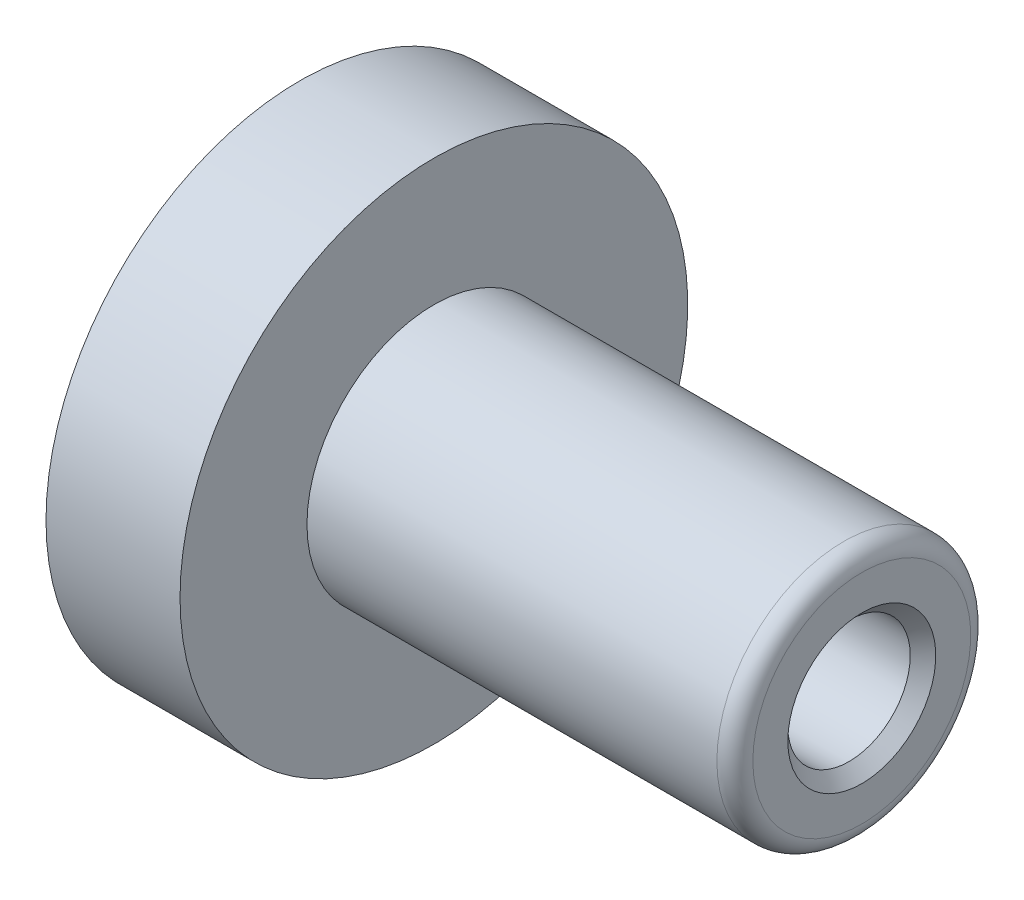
ISO-10303-21;
HEADER;
FILE_DESCRIPTION(('STEP AP214'),'2;1');
FILE_NAME('part.step','',(''),(''),'','','');
FILE_SCHEMA(('AUTOMOTIVE_DESIGN { 1 0 10303 214 1 1 1 1 }'));
ENDSEC;
DATA;
#1=APPLICATION_CONTEXT('core data for automotive mechanical design processes');
#2=APPLICATION_PROTOCOL_DEFINITION('international standard','automotive_design',2000,#1);
#3=PRODUCT_CONTEXT('',#1,'mechanical');
#4=PRODUCT('Part','Part','',(#3));
#5=PRODUCT_RELATED_PRODUCT_CATEGORY('part','',(#4));
#6=PRODUCT_DEFINITION_FORMATION('','',#4);
#7=PRODUCT_DEFINITION_CONTEXT('part definition',#1,'design');
#8=PRODUCT_DEFINITION('design','',#6,#7);
#9=PRODUCT_DEFINITION_SHAPE('','',#8);
#10=(LENGTH_UNIT() NAMED_UNIT(*) SI_UNIT(.MILLI.,.METRE.));
#11=(NAMED_UNIT(*) PLANE_ANGLE_UNIT() SI_UNIT($,.RADIAN.));
#12=(NAMED_UNIT(*) SI_UNIT($,.STERADIAN.) SOLID_ANGLE_UNIT());
#13=UNCERTAINTY_MEASURE_WITH_UNIT(LENGTH_MEASURE(1.E-05),#10,'distance_accuracy_value','');
#14=(GEOMETRIC_REPRESENTATION_CONTEXT(3) GLOBAL_UNCERTAINTY_ASSIGNED_CONTEXT((#13)) GLOBAL_UNIT_ASSIGNED_CONTEXT((#10,
#11,#12)) REPRESENTATION_CONTEXT('',''));
#15=CARTESIAN_POINT('',(0.,0.,0.));
#16=DIRECTION('',(0.,0.,1.));
#17=DIRECTION('',(1.,0.,0.));
#18=AXIS2_PLACEMENT_3D('',#15,#16,#17);
#19=CARTESIAN_POINT('',(0.,0.,0.));
#20=DIRECTION('',(-1.,0.,0.));
#21=DIRECTION('',(0.,0.,1.));
#22=AXIS2_PLACEMENT_3D('',#19,#20,#21);
#23=CYLINDRICAL_SURFACE('',#22,8.128);
#24=CARTESIAN_POINT('',(28.067,0.,0.));
#25=DIRECTION('',(-1.,0.,0.));
#26=DIRECTION('',(0.,0.,1.));
#27=AXIS2_PLACEMENT_3D('',#24,#25,#26);
#28=CIRCLE('',#27,8.128);
#29=CARTESIAN_POINT('',(28.067,0.,8.128));
#30=VERTEX_POINT('',#29);
#31=EDGE_CURVE('E42',#30,#30,#28,.T.);
#32=ORIENTED_EDGE('',*,*,#31,.F.);
#33=EDGE_LOOP('',(#32));
#34=FACE_BOUND('',#33,.T.);
#35=CARTESIAN_POINT('',(0.,0.,0.));
#36=DIRECTION('',(-1.,0.,0.));
#37=DIRECTION('',(0.,0.,1.));
#38=AXIS2_PLACEMENT_3D('',#35,#36,#37);
#39=CIRCLE('',#38,8.128);
#40=CARTESIAN_POINT('',(0.,0.,8.128));
#41=VERTEX_POINT('',#40);
#42=EDGE_CURVE('E63',#41,#41,#39,.T.);
#43=ORIENTED_EDGE('',*,*,#42,.T.);
#44=EDGE_LOOP('',(#43));
#45=FACE_BOUND('',#44,.T.);
#46=ADVANCED_FACE('F31',(#34,#45),#23,.F.);
#47=CARTESIAN_POINT('',(28.067,8.128,0.));
#48=DIRECTION('',(1.,0.,0.));
#49=DIRECTION('',(0.,0.,-1.));
#50=AXIS2_PLACEMENT_3D('',#47,#48,#49);
#51=PLANE('',#50);
#52=ORIENTED_EDGE('',*,*,#31,.T.);
#53=EDGE_LOOP('',(#52));
#54=FACE_BOUND('',#53,.T.);
#55=ADVANCED_FACE('F97',(#54),#51,.F.);
#56=CARTESIAN_POINT('',(49.1998,9.5377,0.));
#57=DIRECTION('',(-1.,0.,0.));
#58=DIRECTION('',(0.,0.,1.));
#59=AXIS2_PLACEMENT_3D('',#56,#57,#58);
#60=PLANE('',#59);
#61=CARTESIAN_POINT('',(49.1998,0.,0.));
#62=DIRECTION('',(-1.,0.,0.));
#63=DIRECTION('',(0.,0.,1.));
#64=AXIS2_PLACEMENT_3D('',#61,#62,#63);
#65=CIRCLE('',#64,6.477);
#66=CARTESIAN_POINT('',(49.1998,0.,6.477));
#67=VERTEX_POINT('',#66);
#68=EDGE_CURVE('E10',#67,#67,#65,.T.);
#69=ORIENTED_EDGE('',*,*,#68,.T.);
#70=EDGE_LOOP('',(#69));
#71=FACE_BOUND('',#70,.T.);
#72=CARTESIAN_POINT('',(49.1998,0.,0.));
#73=DIRECTION('',(-1.,0.,0.));
#74=DIRECTION('',(0.,0.,1.));
#75=AXIS2_PLACEMENT_3D('',#72,#73,#74);
#76=CIRCLE('',#75,9.5377);
#77=CARTESIAN_POINT('',(49.1998,0.,9.5377));
#78=VERTEX_POINT('',#77);
#79=EDGE_CURVE('E46',#78,#78,#76,.T.);
#80=ORIENTED_EDGE('',*,*,#79,.F.);
#81=EDGE_LOOP('',(#80));
#82=FACE_BOUND('',#81,.T.);
#83=ADVANCED_FACE('F102',(#71,#82),#60,.F.);
#84=CARTESIAN_POINT('',(47.625,0.,0.));
#85=DIRECTION('',(-1.,0.,0.));
#86=DIRECTION('',(0.,0.,1.));
#87=AXIS2_PLACEMENT_3D('',#84,#85,#86);
#88=TOROIDAL_SURFACE('',#87,9.5377,1.5748);
#89=CARTESIAN_POINT('',(47.625,0.,0.));
#90=DIRECTION('',(-1.,0.,0.));
#91=DIRECTION('',(0.,0.,1.));
#92=AXIS2_PLACEMENT_3D('',#89,#90,#91);
#93=CIRCLE('',#92,11.1125);
#94=CARTESIAN_POINT('',(47.625,0.,11.1125));
#95=VERTEX_POINT('',#94);
#96=EDGE_CURVE('E51',#95,#95,#93,.T.);
#97=ORIENTED_EDGE('',*,*,#96,.F.);
#98=EDGE_LOOP('',(#97));
#99=FACE_BOUND('',#98,.T.);
#100=ORIENTED_EDGE('',*,*,#79,.T.);
#101=EDGE_LOOP('',(#100));
#102=FACE_BOUND('',#101,.T.);
#103=ADVANCED_FACE('F110',(#99,#102),#88,.T.);
#104=CARTESIAN_POINT('',(0.,0.,0.));
#105=DIRECTION('',(-1.,0.,0.));
#106=DIRECTION('',(0.,0.,1.));
#107=AXIS2_PLACEMENT_3D('',#104,#105,#106);
#108=CYLINDRICAL_SURFACE('',#107,11.1125);
#109=CARTESIAN_POINT('',(11.7348,0.,0.));
#110=DIRECTION('',(-1.,0.,0.));
#111=DIRECTION('',(0.,0.,1.));
#112=AXIS2_PLACEMENT_3D('',#109,#110,#111);
#113=CIRCLE('',#112,11.1125);
#114=CARTESIAN_POINT('',(11.7348,0.,11.1125));
#115=VERTEX_POINT('',#114);
#116=EDGE_CURVE('E54',#115,#115,#113,.T.);
#117=ORIENTED_EDGE('',*,*,#116,.F.);
#118=EDGE_LOOP('',(#117));
#119=FACE_BOUND('',#118,.T.);
#120=ORIENTED_EDGE('',*,*,#96,.T.);
#121=EDGE_LOOP('',(#120));
#122=FACE_BOUND('',#121,.T.);
#123=ADVANCED_FACE('F113',(#119,#122),#108,.T.);
#124=CARTESIAN_POINT('',(11.7348,22.225,0.));
#125=DIRECTION('',(-1.,0.,0.));
#126=DIRECTION('',(0.,0.,1.));
#127=AXIS2_PLACEMENT_3D('',#124,#125,#126);
#128=PLANE('',#127);
#129=CARTESIAN_POINT('',(11.7348,0.,0.));
#130=DIRECTION('',(-1.,0.,0.));
#131=DIRECTION('',(0.,0.,1.));
#132=AXIS2_PLACEMENT_3D('',#129,#130,#131);
#133=CIRCLE('',#132,22.225);
#134=CARTESIAN_POINT('',(11.7348,0.,22.225));
#135=VERTEX_POINT('',#134);
#136=EDGE_CURVE('E57',#135,#135,#133,.T.);
#137=ORIENTED_EDGE('',*,*,#136,.F.);
#138=EDGE_LOOP('',(#137));
#139=FACE_BOUND('',#138,.T.);
#140=ORIENTED_EDGE('',*,*,#116,.T.);
#141=EDGE_LOOP('',(#140));
#142=FACE_BOUND('',#141,.T.);
#143=ADVANCED_FACE('F117',(#139,#142),#128,.F.);
#144=CARTESIAN_POINT('',(0.,0.,0.));
#145=DIRECTION('',(-1.,0.,0.));
#146=DIRECTION('',(0.,0.,1.));
#147=AXIS2_PLACEMENT_3D('',#144,#145,#146);
#148=CYLINDRICAL_SURFACE('',#147,22.225);
#149=CARTESIAN_POINT('',(0.,0.,0.));
#150=DIRECTION('',(-1.,0.,0.));
#151=DIRECTION('',(0.,0.,1.));
#152=AXIS2_PLACEMENT_3D('',#149,#150,#151);
#153=CIRCLE('',#152,22.225);
#154=CARTESIAN_POINT('',(0.,0.,22.225));
#155=VERTEX_POINT('',#154);
#156=EDGE_CURVE('E60',#155,#155,#153,.T.);
#157=ORIENTED_EDGE('',*,*,#156,.F.);
#158=EDGE_LOOP('',(#157));
#159=FACE_BOUND('',#158,.T.);
#160=ORIENTED_EDGE('',*,*,#136,.T.);
#161=EDGE_LOOP('',(#160));
#162=FACE_BOUND('',#161,.T.);
#163=ADVANCED_FACE('F121',(#159,#162),#148,.T.);
#164=CARTESIAN_POINT('',(0.,8.128,0.));
#165=DIRECTION('',(1.,0.,0.));
#166=DIRECTION('',(0.,0.,-1.));
#167=AXIS2_PLACEMENT_3D('',#164,#165,#166);
#168=PLANE('',#167);
#169=CARTESIAN_POINT('',(0.,-12.7,0.));
#170=DIRECTION('',(-1.,0.,0.));
#171=DIRECTION('',(0.,0.,-1.));
#172=AXIS2_PLACEMENT_3D('',#169,#170,#171);
#173=CIRCLE('',#172,3.2004);
#174=CARTESIAN_POINT('',(0.,-12.7,-3.2004));
#175=VERTEX_POINT('',#174);
#176=EDGE_CURVE('E73',#175,#175,#173,.T.);
#177=ORIENTED_EDGE('',*,*,#176,.F.);
#178=EDGE_LOOP('',(#177));
#179=FACE_BOUND('',#178,.T.);
#180=CARTESIAN_POINT('',(0.,12.7,0.));
#181=DIRECTION('',(-1.,0.,0.));
#182=DIRECTION('',(0.,0.,1.));
#183=AXIS2_PLACEMENT_3D('',#180,#181,#182);
#184=CIRCLE('',#183,3.2004);
#185=CARTESIAN_POINT('',(0.,12.7,3.2004));
#186=VERTEX_POINT('',#185);
#187=EDGE_CURVE('E67',#186,#186,#184,.T.);
#188=ORIENTED_EDGE('',*,*,#187,.F.);
#189=EDGE_LOOP('',(#188));
#190=FACE_BOUND('',#189,.T.);
#191=ORIENTED_EDGE('',*,*,#42,.F.);
#192=EDGE_LOOP('',(#191));
#193=FACE_BOUND('',#192,.T.);
#194=ORIENTED_EDGE('',*,*,#156,.T.);
#195=EDGE_LOOP('',(#194));
#196=FACE_BOUND('',#195,.T.);
#197=ADVANCED_FACE('F125',(#179,#190,#193,#196),#168,.F.);
#198=CARTESIAN_POINT('',(7.9502,12.7,0.));
#199=DIRECTION('',(-1.,0.,0.));
#200=DIRECTION('',(0.,0.,1.));
#201=AXIS2_PLACEMENT_3D('',#198,#199,#200);
#202=CYLINDRICAL_SURFACE('',#201,3.2004);
#203=CARTESIAN_POINT('',(7.9502,12.7,0.));
#204=DIRECTION('',(-1.,0.,0.));
#205=DIRECTION('',(0.,0.,1.));
#206=AXIS2_PLACEMENT_3D('',#203,#204,#205);
#207=CIRCLE('',#206,3.2004);
#208=CARTESIAN_POINT('',(7.9502,12.7,3.2004));
#209=VERTEX_POINT('',#208);
#210=EDGE_CURVE('E66',#209,#209,#207,.T.);
#211=ORIENTED_EDGE('',*,*,#210,.F.);
#212=EDGE_LOOP('',(#211));
#213=FACE_BOUND('',#212,.T.);
#214=ORIENTED_EDGE('',*,*,#187,.T.);
#215=EDGE_LOOP('',(#214));
#216=FACE_BOUND('',#215,.T.);
#217=ADVANCED_FACE('F129',(#213,#216),#202,.F.);
#218=CARTESIAN_POINT('',(7.9502,12.7,0.));
#219=DIRECTION('',(-1.,0.,0.));
#220=DIRECTION('',(0.,0.,1.));
#221=AXIS2_PLACEMENT_3D('',#218,#219,#220);
#222=PLANE('',#221);
#223=ORIENTED_EDGE('',*,*,#210,.T.);
#224=EDGE_LOOP('',(#223));
#225=FACE_BOUND('',#224,.T.);
#226=ADVANCED_FACE('F133',(#225),#222,.T.);
#227=CARTESIAN_POINT('',(7.9502,-12.7,0.));
#228=DIRECTION('',(-1.,0.,0.));
#229=DIRECTION('',(0.,0.,1.));
#230=AXIS2_PLACEMENT_3D('',#227,#228,#229);
#231=CYLINDRICAL_SURFACE('',#230,3.2004);
#232=CARTESIAN_POINT('',(7.9502,-12.7,0.));
#233=DIRECTION('',(-1.,0.,0.));
#234=DIRECTION('',(0.,0.,-1.));
#235=AXIS2_PLACEMENT_3D('',#232,#233,#234);
#236=CIRCLE('',#235,3.2004);
#237=CARTESIAN_POINT('',(7.9502,-12.7,-3.2004));
#238=VERTEX_POINT('',#237);
#239=EDGE_CURVE('E70',#238,#238,#236,.T.);
#240=ORIENTED_EDGE('',*,*,#239,.F.);
#241=EDGE_LOOP('',(#240));
#242=FACE_BOUND('',#241,.T.);
#243=ORIENTED_EDGE('',*,*,#176,.T.);
#244=EDGE_LOOP('',(#243));
#245=FACE_BOUND('',#244,.T.);
#246=ADVANCED_FACE('F93',(#242,#245),#231,.F.);
#247=CARTESIAN_POINT('',(7.9502,-12.7,0.));
#248=DIRECTION('',(1.,0.,0.));
#249=DIRECTION('',(0.,0.,-1.));
#250=AXIS2_PLACEMENT_3D('',#247,#248,#249);
#251=PLANE('',#250);
#252=ORIENTED_EDGE('',*,*,#239,.T.);
#253=EDGE_LOOP('',(#252));
#254=FACE_BOUND('',#253,.T.);
#255=ADVANCED_FACE('F86',(#254),#251,.F.);
#256=CARTESIAN_POINT('',(30.6324,0.,0.));
#257=DIRECTION('',(1.,0.,0.));
#258=DIRECTION('',(0.,0.,-1.));
#259=AXIS2_PLACEMENT_3D('',#256,#257,#258);
#260=CYLINDRICAL_SURFACE('',#259,5.3594);
#261=CARTESIAN_POINT('',(48.0822,0.,0.));
#262=DIRECTION('',(-1.,0.,0.));
#263=DIRECTION('',(0.,0.,1.));
#264=AXIS2_PLACEMENT_3D('',#261,#262,#263);
#265=CIRCLE('',#264,5.3594);
#266=CARTESIAN_POINT('',(48.0822,0.,5.3594));
#267=VERTEX_POINT('',#266);
#268=EDGE_CURVE('E38',#267,#267,#265,.F.);
#269=ORIENTED_EDGE('',*,*,#268,.T.);
#270=EDGE_LOOP('',(#269));
#271=FACE_BOUND('',#270,.T.);
#272=CARTESIAN_POINT('',(30.6324,0.,0.));
#273=DIRECTION('',(1.,0.,0.));
#274=DIRECTION('',(0.,0.,-1.));
#275=AXIS2_PLACEMENT_3D('',#272,#273,#274);
#276=CIRCLE('',#275,5.3594);
#277=CARTESIAN_POINT('',(30.6324,0.,-5.3594));
#278=VERTEX_POINT('',#277);
#279=EDGE_CURVE('E76',#278,#278,#276,.T.);
#280=ORIENTED_EDGE('',*,*,#279,.F.);
#281=EDGE_LOOP('',(#280));
#282=FACE_BOUND('',#281,.T.);
#283=ADVANCED_FACE('F84',(#271,#282),#260,.F.);
#284=CARTESIAN_POINT('',(30.6324,0.,0.));
#285=DIRECTION('',(1.,0.,0.));
#286=DIRECTION('',(0.,0.,-1.));
#287=AXIS2_PLACEMENT_3D('',#284,#285,#286);
#288=PLANE('',#287);
#289=ORIENTED_EDGE('',*,*,#279,.T.);
#290=EDGE_LOOP('',(#289));
#291=FACE_BOUND('',#290,.T.);
#292=ADVANCED_FACE('F82',(#291),#288,.T.);
#293=CARTESIAN_POINT('',(48.0822,0.,0.));
#294=DIRECTION('',(1.,0.,0.));
#295=DIRECTION('',(0.,0.,-1.));
#296=AXIS2_PLACEMENT_3D('',#293,#294,#295);
#297=CONICAL_SURFACE('',#296,5.3594,0.785398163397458);
#298=ORIENTED_EDGE('',*,*,#68,.F.);
#299=EDGE_LOOP('',(#298));
#300=FACE_BOUND('',#299,.T.);
#301=ORIENTED_EDGE('',*,*,#268,.F.);
#302=EDGE_LOOP('',(#301));
#303=FACE_BOUND('',#302,.T.);
#304=ADVANCED_FACE('F33',(#300,#303),#297,.F.);
#305=CLOSED_SHELL('',(#46,#55,#83,#103,#123,#143,#163,#197,#217,#226,#246,#255,#283,#292,#304));
#306=MANIFOLD_SOLID_BREP('B2',#305);
#307=ADVANCED_BREP_SHAPE_REPRESENTATION('',(#18,#306),#14);
#308=SHAPE_DEFINITION_REPRESENTATION(#9,#307);
ENDSEC;
END-ISO-10303-21;
